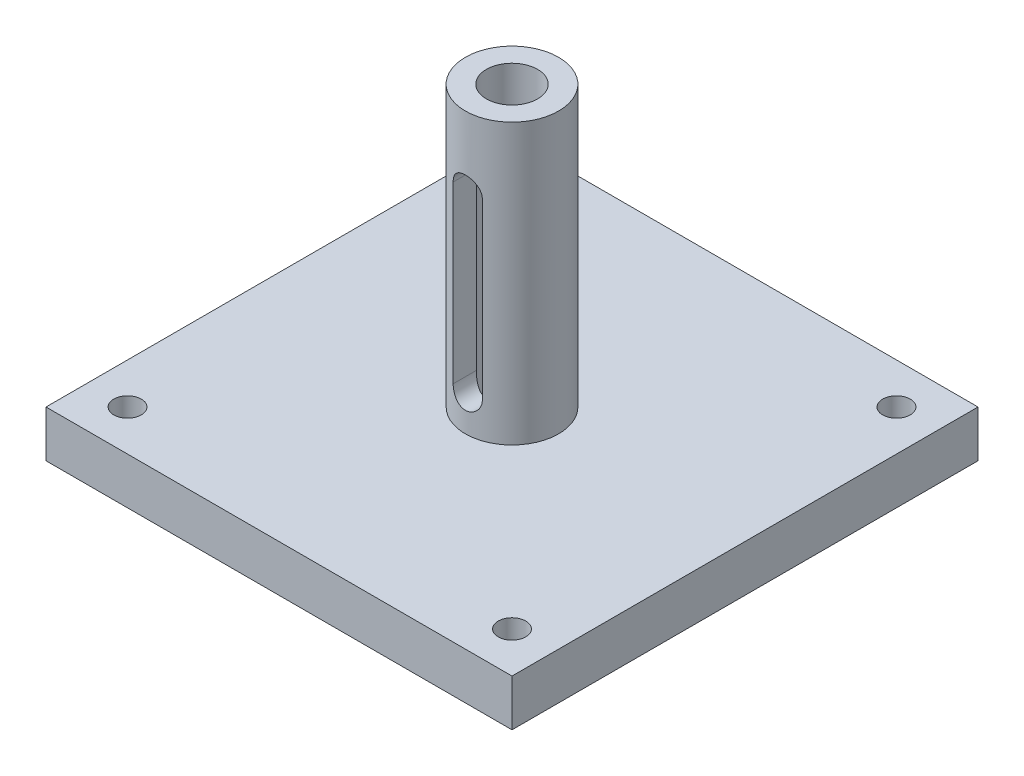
from build123d import *

# Parameters (mm, degrees)
SKETCH1_W               = 50.8
SKETCH1_H               = 50.8
BOSS_EXTRUDE1_DEPTH     = 5.08
SKETCH2_R               = 5.08
SKETCH2_R_2             = 2.794
BOSS_EXTRUDE2_DEPTH     = 30.48
CUT_EXTRUDE1_DEPTH      = 51.545361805
CUT_EXTRUDE1_DEPTH_BACK = 51.545361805
SKETCH4_R               = 1.5875
CUT_EXTRUDE2_DEPTH      = 48.109982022
SKETCH5_R               = 1.49987
CUT_EXTRUDE3_DEPTH      = 48.109982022


with BuildPart() as part:
    # Sketch1 → Boss-Extrude1 (new body)
    with BuildSketch(Plane(origin=(0, 0, 0), x_dir=(1, 0, 0), z_dir=(0, 1, 0))):
        Rectangle(SKETCH1_W, SKETCH1_H)
    extrude(amount=BOSS_EXTRUDE1_DEPTH)

    # Sketch2 → Boss-Extrude2 (add)
    with BuildSketch(Plane(origin=(0, 5.08, 0), x_dir=(1, 0, 0), z_dir=(0, 1, 0))):
        with Locations(Location((0, 0, 0), (0, 0, 90))):
            Circle(SKETCH2_R)
        with Locations(Location((0, 0, 0), (0, 0, 90))):
            Circle(SKETCH2_R_2, mode=Mode.SUBTRACT)
    extrude(amount=BOSS_EXTRUDE2_DEPTH)

    # Sketch3 → Cut-Extrude1 (cut, two sides: drawn at the far end of the back side and taken through both)
    with BuildSketch(Plane.XY.offset(-CUT_EXTRUDE1_DEPTH_BACK)):
        with BuildLine():
            Line((1.5875, 27.94), (1.5875, 8.89))
            ThreePointArc((1.5875, 8.89), (0, 7.3025), (-1.5875, 8.89))
            Line((-1.5875, 8.89), (-1.5875, 27.94))
            ThreePointArc((-1.5875, 27.94), (0, 29.5275), (1.5875, 27.94))
        make_face()
    extrude(amount=CUT_EXTRUDE1_DEPTH + CUT_EXTRUDE1_DEPTH_BACK, mode=Mode.SUBTRACT)

    # Sketch4 → Cut-Extrude2 (cut, through all)
    with BuildSketch(Plane(origin=(0, 5.08, 0), x_dir=(1, 0, 0), z_dir=(0, 1, 0))):
        with Locations(Location((0, 0, 0), (0, 0, 270))):
            Circle(SKETCH4_R)
    extrude(amount=-CUT_EXTRUDE2_DEPTH, mode=Mode.SUBTRACT)

    # Sketch5 → Cut-Extrude3 (cut, through all)
    with BuildSketch(Plane(origin=(0, 5.08, 0), x_dir=(1, 0, 0), z_dir=(0, 1, 0))):
        with Locations(Location((-20.955, 20.955, 0), (0, 0, 270))):
            Circle(SKETCH5_R)
        with Locations(Location((20.955, 20.955, 0), (0, 0, 270))):
            Circle(SKETCH5_R)
        with Locations(Location((-20.955, -20.955, 0), (0, 0, 270))):
            Circle(SKETCH5_R)
        with Locations(Location((20.955, -20.955, 0), (0, 0, 270))):
            Circle(SKETCH5_R)
    extrude(amount=-CUT_EXTRUDE3_DEPTH, mode=Mode.SUBTRACT)


solid = part.part
